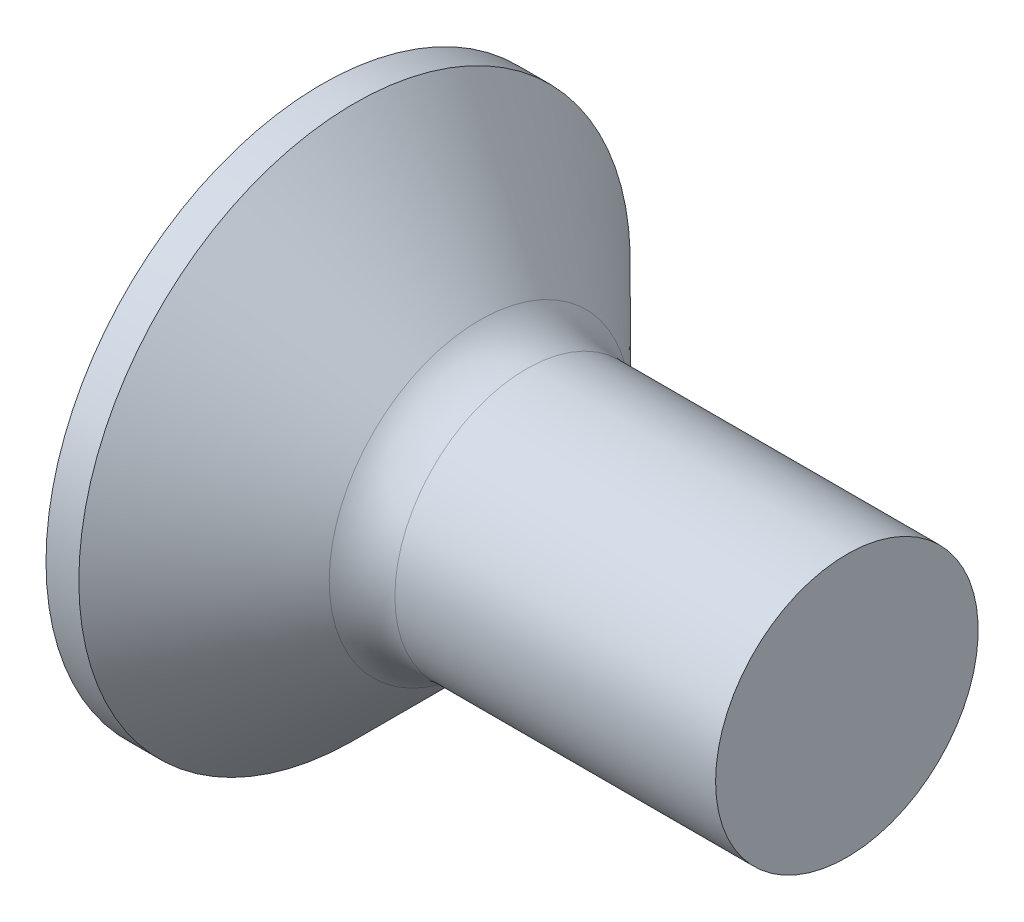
from build123d import *

# Parameters (mm, degrees)
FILLET1_R    = 1
RECPAT_COUNT = 2
RECPAT_ANGLE = 90


with BuildPart() as part:
    # BodySke → Base-Revolve (revolve)
    with BuildSketch(Plane.XY, mode=Mode.PRIVATE) as base_revolve_sk:
        Polygon((0, 0), (0, 4.2), (0.5, 4.2), (2.7, 2), (8, 2), (8, 0), align=None)
    revolve(base_revolve_sk.sketch.rotate(Axis((-6.35, 0, 0), (1, 0, 0)), 90), axis=Axis((-6.35, 0, 0), (1, 0, 0)))

    # Fillet1
    fillet1_edges = [part.edges().sort_by_distance(p)[0] for p in [
        (2.7, 0, -2),
    ]]
    fillet(fillet1_edges, radius=FILLET1_R)

    # Sketch3 → Recess section 0
    with BuildSketch(Plane.ZY):
        with BuildLine():
            Line((-0.515, 2.2), (0.515, 2.2))
            Line((0.515, 2.2), (0.515, -2.2))
            Line((0.515, -2.2), (-0.515, -2.2))
            Line((-0.515, -2.2), (-0.515, 2.2))
        make_face()
    # Sketch4 → Recess section 1
    with BuildSketch(Plane.ZY.offset(-2.51)):
        with BuildLine():
            Line((-0.515, 0.948560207), (0.515, 0.948560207))
            Line((0.515, 0.948560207), (0.515, -0.948560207))
            Line((0.515, -0.948560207), (-0.515, -0.948560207))
            Line((-0.515, -0.948560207), (-0.515, 0.948560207))
        make_face()
    recess = loft(mode=Mode.SUBTRACT)

    # RecPat: Recess ×2 about axis
    recpat_axis = Axis((0, 0, 0), (1, 0, 0))
    for i in range(1, RECPAT_COUNT):
        add(recess.rotate(recpat_axis, i * RECPAT_ANGLE / (RECPAT_COUNT - 1)), mode=Mode.SUBTRACT)

    # RecCorSke → RecessCore (revolve, cut)
    with BuildSketch(Plane.XY, mode=Mode.PRIVATE) as recesscore_sk:
        Polygon((0, 0), (0, 1.026516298), (2.51, 0.851), (2.786506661, 0), align=None)
    revolve(recesscore_sk.sketch.rotate(Axis((-3.175, 0, 0), (1, 0, 0)), 90), axis=Axis((-3.175, 0, 0), (1, 0, 0)), mode=Mode.SUBTRACT)


solid = part.part
